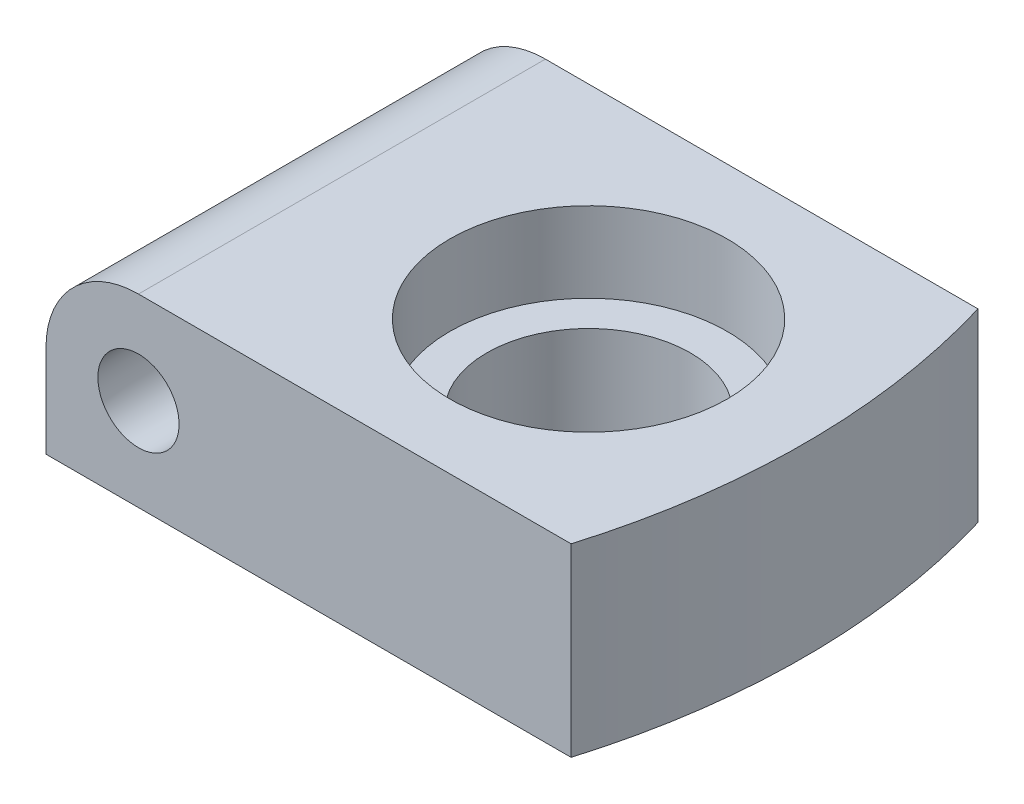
from build123d import *

# Parameters (mm, degrees)
EXTRUDE1_DEPTH = 30
FILLET1_R      = 15
SKETCH4_R      = 7
SKETCH5_R      = 6.5


with BuildPart() as part:
    # Sketch2 → Extrude1 (new body)
    with BuildSketch(Plane(origin=(0, 0, 0), x_dir=(1, 0, 0), z_dir=(0, 1, 0))):
        with BuildLine():
            Line((-45, -33), (40.163514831, -33))
            ThreePointArc((40.163514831, -33), (45, 0), (40.163514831, 33))
            Line((40.163514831, 33), (-45, 33))
            Line((-45, 33), (-45, -33))
        make_face()
    extrude(amount=EXTRUDE1_DEPTH)

    # Fillet1
    fillet1_edges = [part.edges().sort_by_distance(p)[0] for p in [
        (-45, 30, 0),
    ]]
    fillet(fillet1_edges, radius=FILLET1_R)

    # Sketch3 → Cut-Revolve1 (revolve, cut)
    with BuildSketch(Plane.XY, mode=Mode.PRIVATE) as cut_revolve1_sk:
        Polygon((10, 30), (32.5, 30), (32.5, 17), (26.5, 17), (26.5, 0), (10, 0), align=None)
    revolve(cut_revolve1_sk.sketch.rotate(Axis((10, 33.273092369, 0), (0, -1, 0)), 180), axis=Axis((10, 33.273092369, 0), (0, -1, 0)), mode=Mode.SUBTRACT)

    # Sketch4 → Cut-Loft1 section 0
    with BuildSketch(Plane.XY.offset(-50)):
        with Locations((-30, 15)):
            Circle(SKETCH4_R)
    # Sketch5 → Cut-Loft1 section 1
    with BuildSketch(Plane.XY.offset(50)):
        with Locations((-30, 15)):
            Circle(SKETCH5_R)
    loft(mode=Mode.SUBTRACT)


solid = part.part
